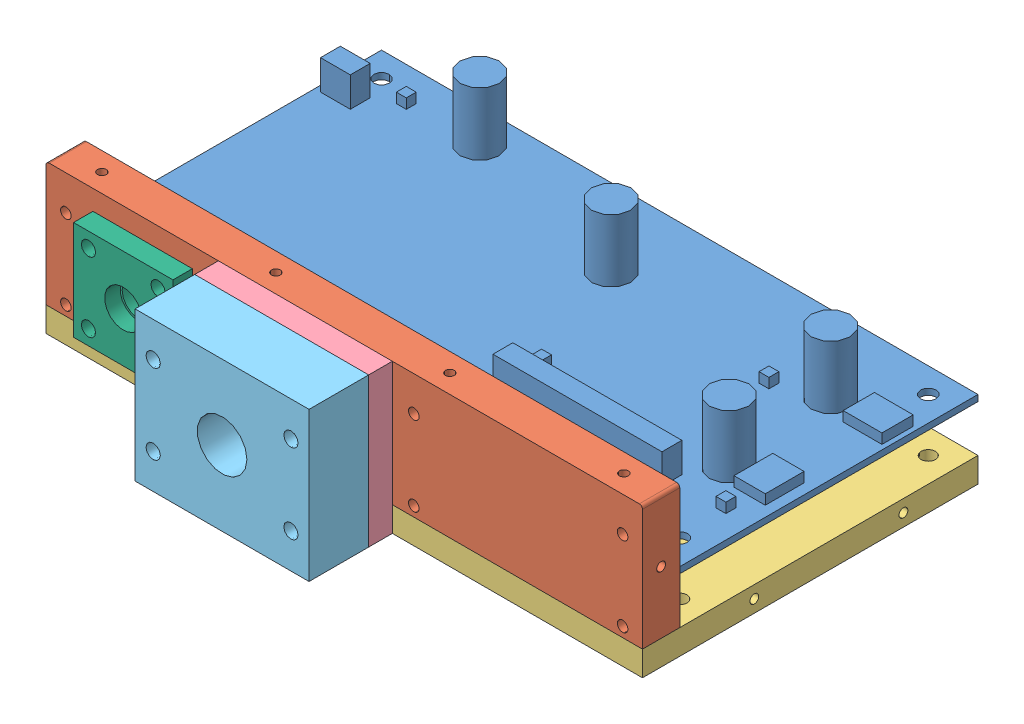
SolidWorks assembly BoxSmall.SLDASM, configuration Default (file format 3100). Lengths in mm.
Overall size (152.4 38.1 107.01).
7 component instances, 7 part files, 18 mates.
Components (placement in the parent):
- NavRangerBoardPart-1: NavRangerBoardPart.SLDPRT [Default] at (-82.0301 -1.2849 0) size (152.4 19.38 81.66)
- NavRangerSmFront-2: NavRangerSmFront.SLDPRT [Default] at (-82.0301 -1.2849 0) size (152.4 31.75 9.53)
- NavRangerSmBase-2: NavRangerSmBase.SLDPRT [Default] at (-82.0301 -19.5411 9.525) size (152.4 6.35 85.72)
- NavRangerSmTop-2: NavRangerSmTop.SLDPRT [Default] at (69.6841 -19.5411 -77.089) x (-1 0 0) z (0 0 -1) (suppressed, hidden)
- NavRangerLensHolder-1: NavRangerLensHolder.SLDPRT [Default] at (-37.9865 -19.5411 9.525) size (44.45 38.1 15.57)
- NavRangerLensRetainer-1: NavRangerLensRetainer.SLDPRT [Default] at (6.4635 -19.5411 30.8102) x (-1 0 0) z (0 0 -1) size (44.45 38.1 15.24)
- NavRangerCollimatorMt-1: NavRangerCollimatorMt.SLDPRT [Default] at (-82.0301 -1.2849 9.525) size (25.4 25.4 9.52)
Mates (geometry in assembly coordinates):
- Concentric1: concentric anti-aligned: circle of NavRangerBoardPart-1 centre (-15.7615 -0.4911 5.461) axis (0 0 1); circle of NavRangerSmFront-2 centre (-15.7615 -0.4911 9.525) axis (0 0 -1)
- Coincident1: coincident: line of NavRangerBoardPart-1; plane of NavRangerSmFront-2 through (-81.2173 17.7461 0) normal (0 0 -1)
- Concentric2: concentric aligned: circle of NavRangerBoardPart-1 centre (-57.3413 0.5058 0) axis (0 0 1); circle of NavRangerSmFront-2 centre (-57.3413 0.5058 4.7625) axis (0 0 1)
- Concentric3: concentric aligned: circle of NavRangerBoardPart-1 centre (-75.6801 0.3026 -69.85) axis (0 1 0); circle of NavRangerSmBase-2 centre (-75.6801 -13.1911 -69.85) axis (0 1 0)
- Concentric4: concentric aligned: circle of NavRangerBoardPart-1 centre (64.0199 0.3026 -6.35) axis (0 1 0); circle of NavRangerSmBase-2 centre (64.0199 -13.1911 -6.35) axis (0 1 0)
- Coincident17: coincident anti-aligned: plane of NavRangerSmFront-2 through (-82.0301 -13.1911 9.525) normal (0 -1 0); plane of NavRangerSmBase-2 through (-82.0301 -13.1911 -76.2) normal (0 1 0)
- Coincident26: coincident anti-aligned: plane of NavRangerSmFront-2 through (-81.2173 17.7461 9.525) normal (0 0 1); plane of NavRangerLensHolder-1 through (-37.9865 18.5589 9.525) normal (0 0 -1)
- Concentric18: concentric aligned: circle of NavRangerSmFront-2 centre (-33.3591 9.6689 9.525) axis (0 0 1); circle of NavRangerLensHolder-1 centre (-33.3591 9.6689 15.5702) axis (0 0 1)
- Coincident27: coincident aligned: plane of NavRangerSmFront-2 through (-81.2173 17.7461 9.525) normal (0 0 1); plane of NavRangerSmTop-2 through (-81.3443 19.4987 9.525) normal (0 0 1)
- Coincident28: coincident anti-aligned: plane of NavRangerLensHolder-1 through (-37.9865 18.5589 15.5702) normal (0 0 1); plane of NavRangerLensRetainer-1 through (6.4635 18.5589 15.5702) normal (0 0 -1)
- Coincident29: coincident anti-aligned: cylinder of NavRangerLensRetainer-1; circle of NavRangerLensHolder-1 centre (-33.3591 9.6689 15.5702) axis (0 0 1)
- Concentric19: concentric anti-aligned: cylinder of NavRangerLensHolder-1; cylinder of NavRangerLensRetainer-1
- Concentric21: concentric aligned: cylinder of NavRangerSmFront-2; cylinder of NavRangerSmTop-2
- Concentric22: concentric aligned: circle of NavRangerSmFront-2 centre (60.8449 18.5589 4.7625) axis (0 1 0); cylinder of NavRangerSmTop-2
- Concentric23: concentric anti-aligned: circle of NavRangerSmFront-2 centre (1.8362 9.6689 9.525) axis (0 0 1); circle of NavRangerLensRetainer-1 centre (1.8362 9.6689 30.8102) axis (0 0 -1)
- Coincident30: coincident anti-aligned: plane of NavRangerSmFront-2 through (-81.2173 17.7461 9.525) normal (0 0 1); plane of NavRangerCollimatorMt-1 through (-70.0413 -11.9148 9.525) normal (0 0 -1)
- Concentric24: concentric anti-aligned: cylinder of NavRangerSmFront-2; cylinder of NavRangerCollimatorMt-1
- Concentric25: concentric aligned: circle of NavRangerSmFront-2 centre (-48.4513 -8.1048 9.525) axis (0 0 1); circle of NavRangerCollimatorMt-1 centre (-48.4513 -8.1048 14.478) axis (0 0 1)
